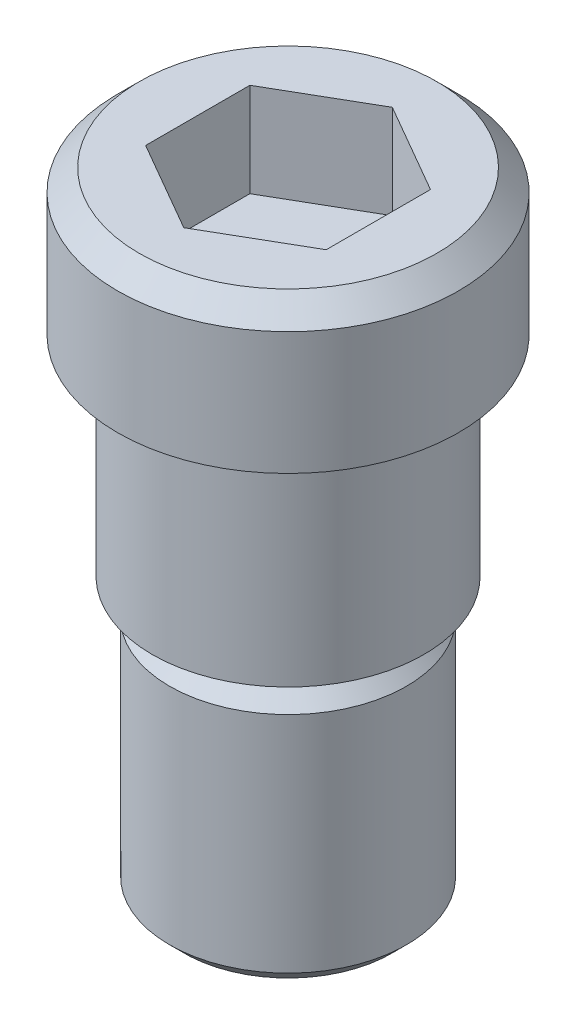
from build123d import *

# Parameters (mm, degrees)
CHAMFER1_SIZE      = 0.381
CHAMFER2_SIZE      = 0.254
CUT_EXTRUDE1_DEPTH = 1.651
CHAMFER3_SIZE      = 0.254


with BuildPart() as part:
    # Sketch1 → Revolve2 (revolve)
    with BuildSketch(Plane.XY, mode=Mode.PRIVATE) as revolve2_sk:
        Polygon((0, 2.54), (-2.9972, 2.54), (-2.9972, 0), (-1.990725, 0), (-1.990725, -0.381), (-2.3876, -0.381), (-2.3876, -3.683), (-1.685925, -3.683), (-1.685925, -4.064), (-2.0828, -4.064), (-2.0828, -8.509), (0, -8.509), align=None)
    revolve(revolve2_sk.sketch.rotate(Axis((0, 7.877937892, 0), (0, -1, 0)), 270), axis=Axis((0, 7.877937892, 0), (0, -1, 0)))

    # Chamfer1
    chamfer1_edges = [part.edges().sort_by_distance(p)[0] for p in [
        (0, 2.54, -2.9972),
    ]]
    chamfer(chamfer1_edges, length=CHAMFER1_SIZE)

    # Chamfer2
    chamfer2_edges = [part.edges().sort_by_distance(p)[0] for p in [
        (0, -8.509, -2.0828),
    ]]
    chamfer(chamfer2_edges, length=CHAMFER2_SIZE)

    # Sketch2 → Cut-Extrude1 (cut)
    with BuildSketch(Plane(origin=(0, 2.54, 0), x_dir=(1, 0, 0), z_dir=(0, 1, 0))):
        Polygon((-1.5875, -0.916543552), (-1.5875, 0.916543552), (0, 1.833087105), (1.5875, 0.916543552), (1.5875, -0.916543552), (0, -1.833087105), align=None)
    extrude(amount=-CUT_EXTRUDE1_DEPTH, mode=Mode.SUBTRACT)

    # Chamfer3
    chamfer3_edges = [part.edges().sort_by_distance(p)[0] for p in [
        (0, -4.064, -2.0828),
    ]]
    chamfer(chamfer3_edges, length=CHAMFER3_SIZE)


solid = part.part
